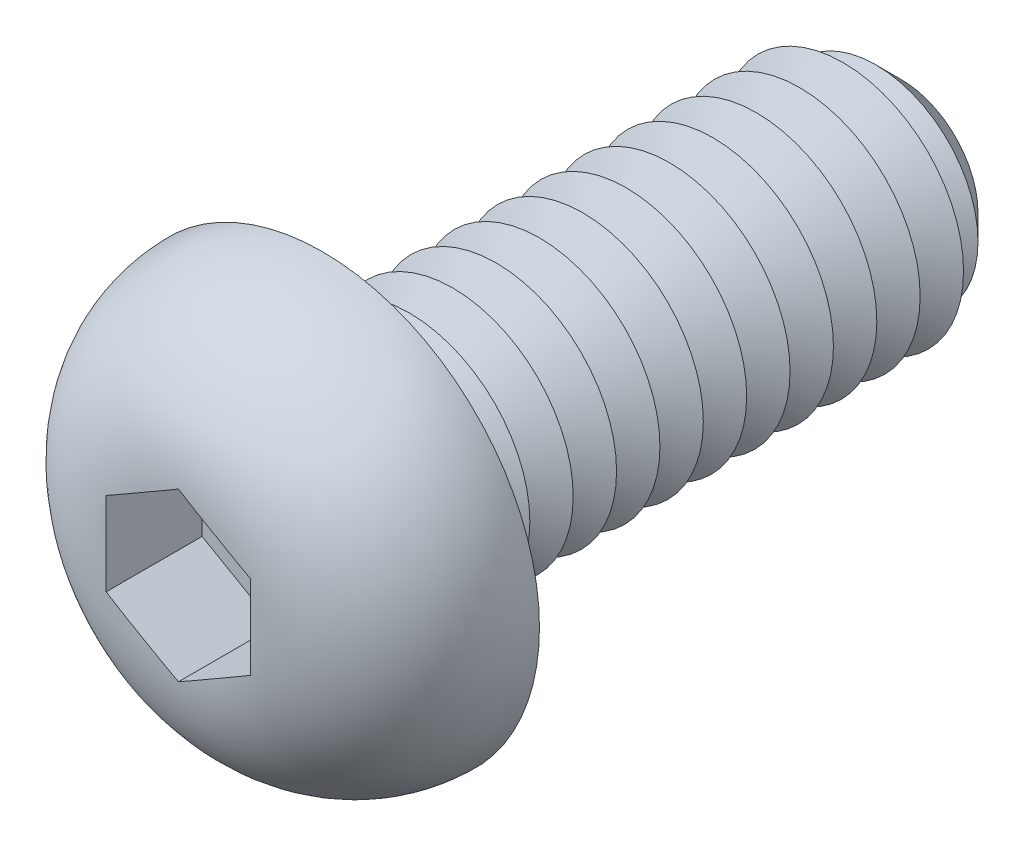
ISO-10303-21;
HEADER;
FILE_DESCRIPTION(('STEP AP214'),'2;1');
FILE_NAME('part.step','',(''),(''),'','','');
FILE_SCHEMA(('AUTOMOTIVE_DESIGN { 1 0 10303 214 1 1 1 1 }'));
ENDSEC;
DATA;
#1=APPLICATION_CONTEXT('core data for automotive mechanical design processes');
#2=APPLICATION_PROTOCOL_DEFINITION('international standard','automotive_design',2000,#1);
#3=PRODUCT_CONTEXT('',#1,'mechanical');
#4=PRODUCT('Part','Part','',(#3));
#5=PRODUCT_RELATED_PRODUCT_CATEGORY('part','',(#4));
#6=PRODUCT_DEFINITION_FORMATION('','',#4);
#7=PRODUCT_DEFINITION_CONTEXT('part definition',#1,'design');
#8=PRODUCT_DEFINITION('design','',#6,#7);
#9=PRODUCT_DEFINITION_SHAPE('','',#8);
#10=(LENGTH_UNIT() NAMED_UNIT(*) SI_UNIT(.MILLI.,.METRE.));
#11=(NAMED_UNIT(*) PLANE_ANGLE_UNIT() SI_UNIT($,.RADIAN.));
#12=(NAMED_UNIT(*) SI_UNIT($,.STERADIAN.) SOLID_ANGLE_UNIT());
#13=UNCERTAINTY_MEASURE_WITH_UNIT(LENGTH_MEASURE(1.E-05),#10,'distance_accuracy_value','');
#14=(GEOMETRIC_REPRESENTATION_CONTEXT(3) GLOBAL_UNCERTAINTY_ASSIGNED_CONTEXT((#13)) GLOBAL_UNIT_ASSIGNED_CONTEXT((#10,
#11,#12)) REPRESENTATION_CONTEXT('',''));
#15=CARTESIAN_POINT('',(0.,0.,0.));
#16=DIRECTION('',(0.,0.,1.));
#17=DIRECTION('',(1.,0.,0.));
#18=AXIS2_PLACEMENT_3D('',#15,#16,#17);
#19=CARTESIAN_POINT('',(0.,0.,-6.));
#20=DIRECTION('',(0.,0.,1.));
#21=DIRECTION('',(1.,0.,0.));
#22=AXIS2_PLACEMENT_3D('',#19,#20,#21);
#23=CYLINDRICAL_SURFACE('',#22,1.25);
#24=CARTESIAN_POINT('',(0.,0.,-0.225));
#25=DIRECTION('',(0.,0.,1.));
#26=DIRECTION('',(1.,0.,0.));
#27=AXIS2_PLACEMENT_3D('',#24,#25,#26);
#28=CIRCLE('',#27,1.25);
#29=CARTESIAN_POINT('',(1.25,0.,-0.225));
#30=VERTEX_POINT('',#29);
#31=EDGE_CURVE('E48',#30,#30,#28,.F.);
#32=ORIENTED_EDGE('',*,*,#31,.T.);
#33=EDGE_LOOP('',(#32));
#34=FACE_BOUND('',#33,.T.);
#35=CARTESIAN_POINT('',(0.,0.,-0.449999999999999));
#36=DIRECTION('',(0.,0.,1.));
#37=DIRECTION('',(1.,0.,0.));
#38=AXIS2_PLACEMENT_3D('',#35,#36,#37);
#39=CIRCLE('',#38,1.25);
#40=CARTESIAN_POINT('',(1.25,0.,-0.449999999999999));
#41=VERTEX_POINT('',#40);
#42=EDGE_CURVE('E116',#41,#41,#39,.T.);
#43=ORIENTED_EDGE('',*,*,#42,.T.);
#44=EDGE_LOOP('',(#43));
#45=FACE_BOUND('',#44,.T.);
#46=ADVANCED_FACE('F39',(#34,#45),#23,.T.);
#47=CARTESIAN_POINT('',(0.,2.25,0.));
#48=DIRECTION('',(0.,0.,1.));
#49=DIRECTION('',(1.,0.,0.));
#50=AXIS2_PLACEMENT_3D('',#47,#48,#49);
#51=PLANE('',#50);
#52=CARTESIAN_POINT('',(0.,0.,0.));
#53=DIRECTION('',(0.,0.,1.));
#54=DIRECTION('',(1.,0.,0.));
#55=AXIS2_PLACEMENT_3D('',#52,#53,#54);
#56=CIRCLE('',#55,1.475);
#57=CARTESIAN_POINT('',(1.475,0.,0.));
#58=VERTEX_POINT('',#57);
#59=EDGE_CURVE('E11',#58,#58,#56,.T.);
#60=ORIENTED_EDGE('',*,*,#59,.T.);
#61=EDGE_LOOP('',(#60));
#62=FACE_BOUND('',#61,.T.);
#63=CARTESIAN_POINT('',(0.,0.,0.));
#64=DIRECTION('',(0.,0.,1.));
#65=DIRECTION('',(1.,0.,0.));
#66=AXIS2_PLACEMENT_3D('',#63,#64,#65);
#67=CIRCLE('',#66,2.25);
#68=CARTESIAN_POINT('',(2.25,0.,0.));
#69=VERTEX_POINT('',#68);
#70=EDGE_CURVE('E140',#69,#69,#67,.T.);
#71=ORIENTED_EDGE('',*,*,#70,.F.);
#72=EDGE_LOOP('',(#71));
#73=FACE_BOUND('',#72,.T.);
#74=ADVANCED_FACE('F251',(#62,#73),#51,.F.);
#75=CARTESIAN_POINT('',(0.,0.,0.));
#76=DIRECTION('',(0.,0.,1.));
#77=DIRECTION('',(1.,0.,0.));
#78=AXIS2_PLACEMENT_3D('',#75,#76,#77);
#79=DEGENERATE_TOROIDAL_SURFACE('',#78,0.75,1.5,.T.);
#80=CARTESIAN_POINT('',(-0.00020000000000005,0.866140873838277,1.49549700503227));
#81=CARTESIAN_POINT('',(0.0310550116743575,0.848095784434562,1.4968946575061));
#82=CARTESIAN_POINT('',(0.0623199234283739,0.83004497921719,1.49783965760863));
#83=CARTESIAN_POINT('',(0.124855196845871,0.793940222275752,1.49913317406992));
#84=CARTESIAN_POINT('',(0.156125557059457,0.775886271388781,1.49948177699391));
#85=CARTESIAN_POINT('',(0.218662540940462,0.739780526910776,1.49989152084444));
#86=CARTESIAN_POINT('',(0.249929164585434,0.7217287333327,1.49995269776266));
#87=CARTESIAN_POINT('',(0.312463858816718,0.685624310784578,1.50000693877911));
#88=CARTESIAN_POINT('',(0.343731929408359,0.667571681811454,1.5));
#89=CARTESIAN_POINT('',(0.40626807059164,0.631466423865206,1.5));
#90=CARTESIAN_POINT('',(0.437536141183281,0.613413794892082,1.50000693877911));
#91=CARTESIAN_POINT('',(0.500070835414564,0.577309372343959,1.49995269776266));
#92=CARTESIAN_POINT('',(0.531337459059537,0.559257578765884,1.49989152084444));
#93=CARTESIAN_POINT('',(0.593874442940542,0.523151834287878,1.49948177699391));
#94=CARTESIAN_POINT('',(0.625144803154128,0.505097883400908,1.49913317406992));
#95=CARTESIAN_POINT('',(0.687680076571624,0.468993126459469,1.49783965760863));
#96=CARTESIAN_POINT('',(0.718944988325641,0.450942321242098,1.49689465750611));
#97=CARTESIAN_POINT('',(0.750199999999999,0.432897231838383,1.4954970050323));
#98=B_SPLINE_CURVE_WITH_KNOTS('',3,(#80,#81,#82,#83,#84,#85,#86,#87,#88,#89,#90,#91,#92,#93,#94,
#95,#96,#97),.UNSPECIFIED.,.F.,.F.,(4,2,2,2,2,2,2,2,4),(0.,0.108340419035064,0.216665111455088,
0.324976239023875,0.433291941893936,0.541607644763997,0.649918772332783,0.758243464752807,
0.866583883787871),.UNSPECIFIED.);
#99=CARTESIAN_POINT('',(0.,0.866025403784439,1.49550596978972));
#100=VERTEX_POINT('',#99);
#101=CARTESIAN_POINT('',(0.75,0.43301270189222,1.49550596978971));
#102=VERTEX_POINT('',#101);
#103=EDGE_CURVE('E62',#100,#102,#98,.T.);
#104=ORIENTED_EDGE('',*,*,#103,.T.);
#105=CARTESIAN_POINT('',(0.75,0.,1.5));
#106=CARTESIAN_POINT('',(0.75,-0.0627080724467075,1.50000006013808));
#107=CARTESIAN_POINT('',(0.75,-0.125416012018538,1.50006294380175));
#108=CARTESIAN_POINT('',(0.75,-0.250852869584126,1.49957707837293));
#109=CARTESIAN_POINT('',(0.75,-0.313581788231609,1.49902814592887));
#110=CARTESIAN_POINT('',(0.75,-0.438802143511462,1.49567950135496));
#111=CARTESIAN_POINT('',(0.75,-0.501293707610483,1.49288685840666));
#112=CARTESIAN_POINT('',(0.75,-0.625982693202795,1.48341085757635));
#113=CARTESIAN_POINT('',(0.75,-0.688180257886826,1.47672964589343));
#114=CARTESIAN_POINT('',(0.75,-0.798866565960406,1.46016399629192));
#115=CARTESIAN_POINT('',(0.75,-0.847497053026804,1.45124406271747));
#116=CARTESIAN_POINT('',(0.75,-0.943962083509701,1.42976864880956));
#117=CARTESIAN_POINT('',(0.75,-0.991796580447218,1.41721295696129));
#118=CARTESIAN_POINT('',(0.75,-1.08630476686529,1.38817887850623));
#119=CARTESIAN_POINT('',(0.75,-1.13297775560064,1.37169818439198));
#120=CARTESIAN_POINT('',(0.75,-1.22469462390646,1.33469293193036));
#121=CARTESIAN_POINT('',(0.75,-1.26973805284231,1.31416726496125));
#122=CARTESIAN_POINT('',(0.75,-1.40247100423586,1.24607127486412));
#123=CARTESIAN_POINT('',(0.750000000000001,-1.48705462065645,1.19219273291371));
#124=CARTESIAN_POINT('',(0.750000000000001,-1.64393724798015,1.06881737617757));
#125=CARTESIAN_POINT('',(0.750000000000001,-1.71623917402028,0.99932427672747));
#126=CARTESIAN_POINT('',(0.750000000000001,-1.83613547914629,0.857842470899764));
#127=CARTESIAN_POINT('',(0.750000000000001,-1.88577468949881,0.787579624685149));
#128=CARTESIAN_POINT('',(0.750000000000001,-1.97175648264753,0.639365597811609));
#129=CARTESIAN_POINT('',(0.750000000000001,-2.00810707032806,0.56141908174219));
#130=CARTESIAN_POINT('',(0.750000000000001,-2.06466924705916,0.404589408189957));
#131=CARTESIAN_POINT('',(0.750000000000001,-2.08563938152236,0.325978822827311));
#132=CARTESIAN_POINT('',(0.750000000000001,-2.11383941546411,0.166329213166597));
#133=CARTESIAN_POINT('',(0.750000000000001,-2.12107071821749,0.0852904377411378));
#134=CARTESIAN_POINT('',(0.750000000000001,-2.12155325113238,-0.0754758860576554));
#135=CARTESIAN_POINT('',(0.750000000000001,-2.11503465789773,-0.155202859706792));
#136=CARTESIAN_POINT('',(0.750000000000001,-2.08869127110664,-0.312426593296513));
#137=CARTESIAN_POINT('',(0.750000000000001,-2.06886647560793,-0.389923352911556));
#138=CARTESIAN_POINT('',(0.750000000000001,-2.01655236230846,-0.540457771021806));
#139=CARTESIAN_POINT('',(0.750000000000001,-1.98407088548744,-0.613498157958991));
#140=CARTESIAN_POINT('',(0.750000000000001,-1.9074704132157,-0.753167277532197));
#141=CARTESIAN_POINT('',(0.750000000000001,-1.86335369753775,-0.81979726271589));
#142=CARTESIAN_POINT('',(0.750000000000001,-1.76418094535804,-0.945786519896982));
#143=CARTESIAN_POINT('',(0.750000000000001,-1.70898715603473,-1.00503724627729));
#144=CARTESIAN_POINT('',(0.750000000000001,-1.58971135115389,-1.11387170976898));
#145=CARTESIAN_POINT('',(0.75,-1.52562045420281,-1.16344566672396));
#146=CARTESIAN_POINT('',(0.75,-1.38780810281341,-1.25370948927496));
#147=CARTESIAN_POINT('',(0.75,-1.31380696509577,-1.29397311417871));
#148=CARTESIAN_POINT('',(0.75,-1.19908931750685,-1.34544517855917));
#149=CARTESIAN_POINT('',(0.75,-1.16029271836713,-1.36109820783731));
#150=CARTESIAN_POINT('',(0.75,-1.08166825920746,-1.38954640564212));
#151=CARTESIAN_POINT('',(0.75,-1.04184052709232,-1.40234192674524));
#152=CARTESIAN_POINT('',(0.75,-0.922724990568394,-1.43614112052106));
#153=CARTESIAN_POINT('',(0.75,-0.842305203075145,-1.45321262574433));
#154=CARTESIAN_POINT('',(0.75,-0.680054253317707,-1.47833811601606));
#155=CARTESIAN_POINT('',(0.75,-0.598220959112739,-1.48637700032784));
#156=CARTESIAN_POINT('',(0.75,-0.432952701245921,-1.4964806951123));
#157=CARTESIAN_POINT('',(0.75,-0.349513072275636,-1.49844778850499));
#158=CARTESIAN_POINT('',(0.75,-0.224384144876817,-1.49972680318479));
#159=CARTESIAN_POINT('',(0.75,-0.182687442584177,-1.49987466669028));
#160=CARTESIAN_POINT('',(0.75,-0.0992944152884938,-1.50001027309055));
#161=CARTESIAN_POINT('',(0.75,-0.0575980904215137,-1.49999802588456));
#162=CARTESIAN_POINT('',(0.75,0.0343362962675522,-1.50000235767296));
#163=CARTESIAN_POINT('',(0.75,0.0845742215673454,-1.50002535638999));
#164=CARTESIAN_POINT('',(0.75,0.185055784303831,-1.49987831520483));
#165=CARTESIAN_POINT('',(0.75,0.235299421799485,-1.49970825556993));
#166=CARTESIAN_POINT('',(0.75,0.335816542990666,-1.49845206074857));
#167=CARTESIAN_POINT('',(0.75,0.386090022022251,-1.49736526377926));
#168=CARTESIAN_POINT('',(0.75,0.486569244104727,-1.49338674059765));
#169=CARTESIAN_POINT('',(0.75,0.536774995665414,-1.49049526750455));
#170=CARTESIAN_POINT('',(0.75,0.636034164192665,-1.4821682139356));
#171=CARTESIAN_POINT('',(0.75,0.685091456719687,-1.47678164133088));
#172=CARTESIAN_POINT('',(0.75,0.78275573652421,-1.46286947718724));
#173=CARTESIAN_POINT('',(0.75,0.831362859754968,-1.45434486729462));
#174=CARTESIAN_POINT('',(0.75,0.92771552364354,-1.43373454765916));
#175=CARTESIAN_POINT('',(0.75,0.975462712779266,-1.42165664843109));
#176=CARTESIAN_POINT('',(0.75,1.06980144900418,-1.39365234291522));
#177=CARTESIAN_POINT('',(0.75,1.11639353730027,-1.37772777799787));
#178=CARTESIAN_POINT('',(0.75,1.20164461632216,-1.3443737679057));
#179=CARTESIAN_POINT('',(0.75,1.24050600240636,-1.32746129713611));
#180=CARTESIAN_POINT('',(0.75,1.31679530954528,-1.29064565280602));
#181=CARTESIAN_POINT('',(0.75,1.35422305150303,-1.27074210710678));
#182=CARTESIAN_POINT('',(0.75,1.42755003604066,-1.22785786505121));
#183=CARTESIAN_POINT('',(0.75,1.46343995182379,-1.20486115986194));
#184=CARTESIAN_POINT('',(0.75,1.53317270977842,-1.15597138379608));
#185=CARTESIAN_POINT('',(0.75,1.56701570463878,-1.1300785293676));
#186=CARTESIAN_POINT('',(0.75,1.66513078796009,-1.04815589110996));
#187=CARTESIAN_POINT('',(0.75,1.72596640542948,-0.987895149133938));
#188=CARTESIAN_POINT('',(0.75,1.83611610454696,-0.857815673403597));
#189=CARTESIAN_POINT('',(0.75,1.88544739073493,-0.78801146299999));
#190=CARTESIAN_POINT('',(0.75,1.96970141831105,-0.64303465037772));
#191=CARTESIAN_POINT('',(0.75,2.00501928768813,-0.568092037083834));
#192=CARTESIAN_POINT('',(0.75,2.06216371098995,-0.413201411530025));
#193=CARTESIAN_POINT('',(0.75,2.08398748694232,-0.333252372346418));
#194=CARTESIAN_POINT('',(0.75,2.11297506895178,-0.173098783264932));
#195=CARTESIAN_POINT('',(0.75,2.12053880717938,-0.0929664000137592));
#196=CARTESIAN_POINT('',(0.75,2.1219864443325,0.0674127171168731));
#197=CARTESIAN_POINT('',(0.75,2.1158724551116,0.147659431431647));
#198=CARTESIAN_POINT('',(0.75,2.09026719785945,0.305329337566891));
#199=CARTESIAN_POINT('',(0.75,2.07088260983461,0.382769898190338));
#200=CARTESIAN_POINT('',(0.75,2.01945905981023,0.53332273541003));
#201=CARTESIAN_POINT('',(0.75,1.98742024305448,0.606435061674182));
#202=CARTESIAN_POINT('',(0.75,1.91146692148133,0.746751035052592));
#203=CARTESIAN_POINT('',(0.75,1.86748433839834,0.813917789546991));
#204=CARTESIAN_POINT('',(0.75,1.76910058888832,0.940116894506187));
#205=CARTESIAN_POINT('',(0.75,1.71469868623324,0.999148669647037));
#206=CARTESIAN_POINT('',(0.75,1.59577189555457,1.10896258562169));
#207=CARTESIAN_POINT('',(0.75,1.53104176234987,1.15952203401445));
#208=CARTESIAN_POINT('',(0.75,1.3944150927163,1.24972990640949));
#209=CARTESIAN_POINT('',(0.75,1.32251811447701,1.28937765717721));
#210=CARTESIAN_POINT('',(0.75,1.16914901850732,1.35951213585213));
#211=CARTESIAN_POINT('',(0.75,1.08736098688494,1.38930295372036));
#212=CARTESIAN_POINT('',(0.75,0.920496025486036,1.43689243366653));
#213=CARTESIAN_POINT('',(0.75,0.835420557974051,1.45469636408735));
#214=CARTESIAN_POINT('',(0.75,0.687870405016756,1.476773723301));
#215=CARTESIAN_POINT('',(0.75,0.625720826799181,1.48343749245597));
#216=CARTESIAN_POINT('',(0.75,0.501109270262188,1.49289411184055));
#217=CARTESIAN_POINT('',(0.75,0.438647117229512,1.49568447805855));
#218=CARTESIAN_POINT('',(0.75,0.313477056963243,1.49903009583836));
#219=CARTESIAN_POINT('',(0.75,0.250769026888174,1.49957783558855));
#220=CARTESIAN_POINT('',(0.75,0.125373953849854,1.50006266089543));
#221=CARTESIAN_POINT('',(0.75,0.0626869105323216,1.49999993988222));
#222=CARTESIAN_POINT('',(0.75,0.,1.5));
#223=B_SPLINE_CURVE_WITH_KNOTS('',3,(#105,#106,#107,#108,#109,#110,#111,#112,#113,#114,#115,
#116,#117,#118,#119,#120,#121,#122,#123,#124,#125,#126,#127,#128,#129,#130,#131,#132,#133,#134,
#135,#136,#137,#138,#139,#140,#141,#142,#143,#144,#145,#146,#147,#148,#149,#150,#151,#152,#153,
#154,#155,#156,#157,#158,#159,#160,#161,#162,#163,#164,#165,#166,#167,#168,#169,#170,#171,#172,
#173,#174,#175,#176,#177,#178,#179,#180,#181,#182,#183,#184,#185,#186,#187,#188,#189,#190,#191,
#192,#193,#194,#195,#196,#197,#198,#199,#200,#201,#202,#203,#204,#205,#206,#207,#208,#209,#210,
#211,#212,#213,#214,#215,#216,#217,#218,#219,#220,#221,#222),.UNSPECIFIED.,.T.,.F.,(4,2,2,2,2,2,
2,2,2,2,2,2,2,2,2,2,2,2,2,2,2,2,2,2,2,2,2,2,2,2,2,2,2,2,2,2,2,2,2,2,2,2,2,2,2,2,2,2,2,2,2,2,2,2,
2,2,2,2,4),(0.,0.188125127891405,0.376306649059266,0.563897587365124,0.75138508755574,
0.899588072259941,1.04779968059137,1.19609863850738,1.34443829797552,1.64330264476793,
1.94209595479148,2.19886247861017,2.45547407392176,2.69837467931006,2.94125047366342,
3.18009276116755,3.418935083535,3.65762967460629,3.89627753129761,4.13810096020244,
4.38016754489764,4.63175737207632,4.75717060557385,4.88256835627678,5.12849835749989,
5.37483889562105,5.62512380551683,5.75021912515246,5.87530671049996,6.02602122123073,
6.17675113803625,6.32758995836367,6.47840762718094,6.62638101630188,6.77430815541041,
6.92191253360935,7.06944639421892,7.19647012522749,7.32350967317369,7.4512340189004,
7.57894882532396,7.83445576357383,8.08957810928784,8.33688433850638,8.58424146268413,
8.82455168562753,9.06482480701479,9.30318875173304,9.54154996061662,9.781299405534,
10.0210657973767,10.266384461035,10.511718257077,10.7718340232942,11.0318353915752,
11.219209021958,11.4067027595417,11.5948240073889,11.7828856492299),.UNSPECIFIED.);
#224=CARTESIAN_POINT('',(0.75,-0.43301270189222,1.49550596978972));
#225=VERTEX_POINT('',#224);
#226=EDGE_CURVE('E215',#102,#225,#223,.T.);
#227=ORIENTED_EDGE('',*,*,#226,.T.);
#228=CARTESIAN_POINT('',(0.7502,-0.432897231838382,1.49549700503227));
#229=CARTESIAN_POINT('',(0.718944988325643,-0.450942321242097,1.4968946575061));
#230=CARTESIAN_POINT('',(0.687680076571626,-0.468993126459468,1.49783965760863));
#231=CARTESIAN_POINT('',(0.625144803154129,-0.505097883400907,1.49913317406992));
#232=CARTESIAN_POINT('',(0.593874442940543,-0.523151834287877,1.49948177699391));
#233=CARTESIAN_POINT('',(0.531337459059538,-0.559257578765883,1.49989152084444));
#234=CARTESIAN_POINT('',(0.500070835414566,-0.577309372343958,1.49995269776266));
#235=CARTESIAN_POINT('',(0.437536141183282,-0.613413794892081,1.50000693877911));
#236=CARTESIAN_POINT('',(0.406268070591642,-0.631466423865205,1.5));
#237=CARTESIAN_POINT('',(0.34373192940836,-0.667571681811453,1.5));
#238=CARTESIAN_POINT('',(0.312463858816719,-0.685624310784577,1.50000693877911));
#239=CARTESIAN_POINT('',(0.249929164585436,-0.721728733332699,1.49995269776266));
#240=CARTESIAN_POINT('',(0.218662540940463,-0.739780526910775,1.49989152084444));
#241=CARTESIAN_POINT('',(0.156125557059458,-0.77588627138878,1.49948177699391));
#242=CARTESIAN_POINT('',(0.124855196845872,-0.793940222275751,1.49913317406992));
#243=CARTESIAN_POINT('',(0.0623199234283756,-0.830044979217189,1.49783965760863));
#244=CARTESIAN_POINT('',(0.0310550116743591,-0.848095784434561,1.49689465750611));
#245=CARTESIAN_POINT('',(-0.000199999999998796,-0.866140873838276,1.4954970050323));
#246=B_SPLINE_CURVE_WITH_KNOTS('',3,(#228,#229,#230,#231,#232,#233,#234,#235,#236,#237,#238,
#239,#240,#241,#242,#243,#244,#245),.UNSPECIFIED.,.F.,.F.,(4,2,2,2,2,2,2,2,4),(0.,
0.108340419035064,0.216665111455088,0.324976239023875,0.433291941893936,0.541607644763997,
0.649918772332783,0.758243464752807,0.866583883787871),.UNSPECIFIED.);
#247=CARTESIAN_POINT('',(0.,-0.866025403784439,1.49550596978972));
#248=VERTEX_POINT('',#247);
#249=EDGE_CURVE('E195',#225,#248,#246,.T.);
#250=ORIENTED_EDGE('',*,*,#249,.T.);
#251=CARTESIAN_POINT('',(0.000200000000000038,-0.866140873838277,1.49549700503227));
#252=CARTESIAN_POINT('',(-0.0310550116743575,-0.848095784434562,1.4968946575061));
#253=CARTESIAN_POINT('',(-0.0623199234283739,-0.83004497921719,1.49783965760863));
#254=CARTESIAN_POINT('',(-0.124855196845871,-0.793940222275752,1.49913317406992));
#255=CARTESIAN_POINT('',(-0.156125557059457,-0.775886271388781,1.49948177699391));
#256=CARTESIAN_POINT('',(-0.218662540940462,-0.739780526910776,1.49989152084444));
#257=CARTESIAN_POINT('',(-0.249929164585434,-0.7217287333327,1.49995269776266));
#258=CARTESIAN_POINT('',(-0.312463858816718,-0.685624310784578,1.50000693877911));
#259=CARTESIAN_POINT('',(-0.343731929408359,-0.667571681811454,1.5));
#260=CARTESIAN_POINT('',(-0.40626807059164,-0.631466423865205,1.5));
#261=CARTESIAN_POINT('',(-0.437536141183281,-0.613413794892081,1.50000693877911));
#262=CARTESIAN_POINT('',(-0.500070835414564,-0.577309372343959,1.49995269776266));
#263=CARTESIAN_POINT('',(-0.531337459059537,-0.559257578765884,1.49989152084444));
#264=CARTESIAN_POINT('',(-0.593874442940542,-0.523151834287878,1.49948177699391));
#265=CARTESIAN_POINT('',(-0.625144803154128,-0.505097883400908,1.49913317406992));
#266=CARTESIAN_POINT('',(-0.687680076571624,-0.468993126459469,1.49783965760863));
#267=CARTESIAN_POINT('',(-0.718944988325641,-0.450942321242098,1.49689465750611));
#268=CARTESIAN_POINT('',(-0.750199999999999,-0.432897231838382,1.4954970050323));
#269=B_SPLINE_CURVE_WITH_KNOTS('',3,(#251,#252,#253,#254,#255,#256,#257,#258,#259,#260,#261,
#262,#263,#264,#265,#266,#267,#268),.UNSPECIFIED.,.F.,.F.,(4,2,2,2,2,2,2,2,4),(0.,
0.108340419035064,0.216665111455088,0.324976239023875,0.433291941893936,0.541607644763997,
0.649918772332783,0.758243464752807,0.866583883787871),.UNSPECIFIED.);
#270=CARTESIAN_POINT('',(-0.75,-0.433012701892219,1.49550596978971));
#271=VERTEX_POINT('',#270);
#272=EDGE_CURVE('E188',#248,#271,#269,.T.);
#273=ORIENTED_EDGE('',*,*,#272,.T.);
#274=CARTESIAN_POINT('',(-0.75,0.,1.5));
#275=CARTESIAN_POINT('',(-0.75,0.0627080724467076,1.50000006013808));
#276=CARTESIAN_POINT('',(-0.75,0.125416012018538,1.50006294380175));
#277=CARTESIAN_POINT('',(-0.75,0.250852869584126,1.49957707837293));
#278=CARTESIAN_POINT('',(-0.75,0.313581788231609,1.49902814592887));
#279=CARTESIAN_POINT('',(-0.75,0.438802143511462,1.49567950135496));
#280=CARTESIAN_POINT('',(-0.75,0.501293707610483,1.49288685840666));
#281=CARTESIAN_POINT('',(-0.75,0.625982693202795,1.48341085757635));
#282=CARTESIAN_POINT('',(-0.75,0.688180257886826,1.47672964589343));
#283=CARTESIAN_POINT('',(-0.75,0.798866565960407,1.46016399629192));
#284=CARTESIAN_POINT('',(-0.75,0.847497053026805,1.45124406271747));
#285=CARTESIAN_POINT('',(-0.75,0.943962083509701,1.42976864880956));
#286=CARTESIAN_POINT('',(-0.75,0.991796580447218,1.41721295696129));
#287=CARTESIAN_POINT('',(-0.75,1.08630476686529,1.38817887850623));
#288=CARTESIAN_POINT('',(-0.75,1.13297775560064,1.37169818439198));
#289=CARTESIAN_POINT('',(-0.75,1.22469462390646,1.33469293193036));
#290=CARTESIAN_POINT('',(-0.75,1.26973805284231,1.31416726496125));
#291=CARTESIAN_POINT('',(-0.75,1.40247100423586,1.24607127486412));
#292=CARTESIAN_POINT('',(-0.75,1.48705462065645,1.19219273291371));
#293=CARTESIAN_POINT('',(-0.75,1.64393724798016,1.06881737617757));
#294=CARTESIAN_POINT('',(-0.75,1.71623917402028,0.99932427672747));
#295=CARTESIAN_POINT('',(-0.75,1.83613547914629,0.857842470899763));
#296=CARTESIAN_POINT('',(-0.75,1.88577468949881,0.787579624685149));
#297=CARTESIAN_POINT('',(-0.75,1.97175648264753,0.639365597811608));
#298=CARTESIAN_POINT('',(-0.75,2.00810707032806,0.561419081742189));
#299=CARTESIAN_POINT('',(-0.75,2.06466924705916,0.404589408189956));
#300=CARTESIAN_POINT('',(-0.75,2.08563938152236,0.325978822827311));
#301=CARTESIAN_POINT('',(-0.75,2.11383941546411,0.166329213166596));
#302=CARTESIAN_POINT('',(-0.75,2.12107071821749,0.0852904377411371));
#303=CARTESIAN_POINT('',(-0.75,2.12155325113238,-0.0754758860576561));
#304=CARTESIAN_POINT('',(-0.75,2.11503465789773,-0.155202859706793));
#305=CARTESIAN_POINT('',(-0.75,2.08869127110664,-0.312426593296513));
#306=CARTESIAN_POINT('',(-0.75,2.06886647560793,-0.389923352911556));
#307=CARTESIAN_POINT('',(-0.75,2.01655236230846,-0.540457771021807));
#308=CARTESIAN_POINT('',(-0.75,1.98407088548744,-0.613498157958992));
#309=CARTESIAN_POINT('',(-0.75,1.9074704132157,-0.753167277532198));
#310=CARTESIAN_POINT('',(-0.75,1.86335369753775,-0.81979726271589));
#311=CARTESIAN_POINT('',(-0.75,1.76418094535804,-0.945786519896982));
#312=CARTESIAN_POINT('',(-0.75,1.70898715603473,-1.00503724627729));
#313=CARTESIAN_POINT('',(-0.75,1.58971135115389,-1.11387170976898));
#314=CARTESIAN_POINT('',(-0.75,1.52562045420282,-1.16344566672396));
#315=CARTESIAN_POINT('',(-0.75,1.38780810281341,-1.25370948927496));
#316=CARTESIAN_POINT('',(-0.75,1.31380696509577,-1.29397311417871));
#317=CARTESIAN_POINT('',(-0.75,1.19908931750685,-1.34544517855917));
#318=CARTESIAN_POINT('',(-0.75,1.16029271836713,-1.36109820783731));
#319=CARTESIAN_POINT('',(-0.75,1.08166825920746,-1.38954640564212));
#320=CARTESIAN_POINT('',(-0.75,1.04184052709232,-1.40234192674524));
#321=CARTESIAN_POINT('',(-0.75,0.922724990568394,-1.43614112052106));
#322=CARTESIAN_POINT('',(-0.75,0.842305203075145,-1.45321262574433));
#323=CARTESIAN_POINT('',(-0.75,0.680054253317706,-1.47833811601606));
#324=CARTESIAN_POINT('',(-0.75,0.598220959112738,-1.48637700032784));
#325=CARTESIAN_POINT('',(-0.75,0.43295270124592,-1.4964806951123));
#326=CARTESIAN_POINT('',(-0.75,0.349513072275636,-1.49844778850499));
#327=CARTESIAN_POINT('',(-0.75,0.224384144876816,-1.49972680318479));
#328=CARTESIAN_POINT('',(-0.75,0.182687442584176,-1.49987466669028));
#329=CARTESIAN_POINT('',(-0.75,0.0992944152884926,-1.50001027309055));
#330=CARTESIAN_POINT('',(-0.75,0.0575980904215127,-1.49999802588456));
#331=CARTESIAN_POINT('',(-0.75,-0.0343362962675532,-1.50000235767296));
#332=CARTESIAN_POINT('',(-0.75,-0.0845742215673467,-1.50002535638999));
#333=CARTESIAN_POINT('',(-0.75,-0.185055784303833,-1.49987831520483));
#334=CARTESIAN_POINT('',(-0.75,-0.235299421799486,-1.49970825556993));
#335=CARTESIAN_POINT('',(-0.75,-0.335816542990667,-1.49845206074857));
#336=CARTESIAN_POINT('',(-0.75,-0.386090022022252,-1.49736526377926));
#337=CARTESIAN_POINT('',(-0.75,-0.486569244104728,-1.49338674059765));
#338=CARTESIAN_POINT('',(-0.75,-0.536774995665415,-1.49049526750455));
#339=CARTESIAN_POINT('',(-0.75,-0.636034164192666,-1.4821682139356));
#340=CARTESIAN_POINT('',(-0.75,-0.685091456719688,-1.47678164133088));
#341=CARTESIAN_POINT('',(-0.75,-0.782755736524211,-1.46286947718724));
#342=CARTESIAN_POINT('',(-0.75,-0.831362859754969,-1.45434486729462));
#343=CARTESIAN_POINT('',(-0.75,-0.927715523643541,-1.43373454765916));
#344=CARTESIAN_POINT('',(-0.75,-0.975462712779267,-1.42165664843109));
#345=CARTESIAN_POINT('',(-0.75,-1.06980144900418,-1.39365234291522));
#346=CARTESIAN_POINT('',(-0.75,-1.11639353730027,-1.37772777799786));
#347=CARTESIAN_POINT('',(-0.75,-1.20164461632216,-1.3443737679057));
#348=CARTESIAN_POINT('',(-0.75,-1.24050600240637,-1.32746129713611));
#349=CARTESIAN_POINT('',(-0.75,-1.31679530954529,-1.29064565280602));
#350=CARTESIAN_POINT('',(-0.75,-1.35422305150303,-1.27074210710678));
#351=CARTESIAN_POINT('',(-0.75,-1.42755003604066,-1.22785786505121));
#352=CARTESIAN_POINT('',(-0.75,-1.46343995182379,-1.20486115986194));
#353=CARTESIAN_POINT('',(-0.75,-1.53317270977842,-1.15597138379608));
#354=CARTESIAN_POINT('',(-0.75,-1.56701570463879,-1.1300785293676));
#355=CARTESIAN_POINT('',(-0.75,-1.66513078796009,-1.04815589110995));
#356=CARTESIAN_POINT('',(-0.75,-1.72596640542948,-0.987895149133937));
#357=CARTESIAN_POINT('',(-0.75,-1.83611610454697,-0.857815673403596));
#358=CARTESIAN_POINT('',(-0.75,-1.88544739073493,-0.788011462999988));
#359=CARTESIAN_POINT('',(-0.75,-1.96970141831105,-0.643034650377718));
#360=CARTESIAN_POINT('',(-0.75,-2.00501928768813,-0.568092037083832));
#361=CARTESIAN_POINT('',(-0.75,-2.06216371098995,-0.413201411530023));
#362=CARTESIAN_POINT('',(-0.75,-2.08398748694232,-0.333252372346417));
#363=CARTESIAN_POINT('',(-0.75,-2.11297506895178,-0.173098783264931));
#364=CARTESIAN_POINT('',(-0.75,-2.12053880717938,-0.0929664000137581));
#365=CARTESIAN_POINT('',(-0.75,-2.1219864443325,0.0674127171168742));
#366=CARTESIAN_POINT('',(-0.75,-2.1158724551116,0.147659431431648));
#367=CARTESIAN_POINT('',(-0.75,-2.09026719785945,0.305329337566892));
#368=CARTESIAN_POINT('',(-0.75,-2.07088260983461,0.382769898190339));
#369=CARTESIAN_POINT('',(-0.75,-2.01945905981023,0.533322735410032));
#370=CARTESIAN_POINT('',(-0.75,-1.98742024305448,0.606435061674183));
#371=CARTESIAN_POINT('',(-0.75,-1.91146692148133,0.746751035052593));
#372=CARTESIAN_POINT('',(-0.75,-1.86748433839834,0.813917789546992));
#373=CARTESIAN_POINT('',(-0.75,-1.76910058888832,0.940116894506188));
#374=CARTESIAN_POINT('',(-0.75,-1.71469868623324,0.999148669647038));
#375=CARTESIAN_POINT('',(-0.75,-1.59577189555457,1.10896258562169));
#376=CARTESIAN_POINT('',(-0.75,-1.53104176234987,1.15952203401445));
#377=CARTESIAN_POINT('',(-0.75,-1.3944150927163,1.24972990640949));
#378=CARTESIAN_POINT('',(-0.75,-1.32251811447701,1.28937765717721));
#379=CARTESIAN_POINT('',(-0.75,-1.16914901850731,1.35951213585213));
#380=CARTESIAN_POINT('',(-0.75,-1.08736098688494,1.38930295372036));
#381=CARTESIAN_POINT('',(-0.75,-0.920496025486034,1.43689243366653));
#382=CARTESIAN_POINT('',(-0.75,-0.83542055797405,1.45469636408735));
#383=CARTESIAN_POINT('',(-0.75,-0.687870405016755,1.476773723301));
#384=CARTESIAN_POINT('',(-0.75,-0.625720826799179,1.48343749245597));
#385=CARTESIAN_POINT('',(-0.75,-0.501109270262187,1.49289411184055));
#386=CARTESIAN_POINT('',(-0.75,-0.438647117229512,1.49568447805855));
#387=CARTESIAN_POINT('',(-0.75,-0.313477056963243,1.49903009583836));
#388=CARTESIAN_POINT('',(-0.75,-0.250769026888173,1.49957783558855));
#389=CARTESIAN_POINT('',(-0.75,-0.125373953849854,1.50006266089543));
#390=CARTESIAN_POINT('',(-0.75,-0.0626869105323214,1.49999993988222));
#391=CARTESIAN_POINT('',(-0.75,0.,1.5));
#392=B_SPLINE_CURVE_WITH_KNOTS('',3,(#274,#275,#276,#277,#278,#279,#280,#281,#282,#283,#284,
#285,#286,#287,#288,#289,#290,#291,#292,#293,#294,#295,#296,#297,#298,#299,#300,#301,#302,#303,
#304,#305,#306,#307,#308,#309,#310,#311,#312,#313,#314,#315,#316,#317,#318,#319,#320,#321,#322,
#323,#324,#325,#326,#327,#328,#329,#330,#331,#332,#333,#334,#335,#336,#337,#338,#339,#340,#341,
#342,#343,#344,#345,#346,#347,#348,#349,#350,#351,#352,#353,#354,#355,#356,#357,#358,#359,#360,
#361,#362,#363,#364,#365,#366,#367,#368,#369,#370,#371,#372,#373,#374,#375,#376,#377,#378,#379,
#380,#381,#382,#383,#384,#385,#386,#387,#388,#389,#390,#391),.UNSPECIFIED.,.T.,.F.,(4,2,2,2,2,2,
2,2,2,2,2,2,2,2,2,2,2,2,2,2,2,2,2,2,2,2,2,2,2,2,2,2,2,2,2,2,2,2,2,2,2,2,2,2,2,2,2,2,2,2,2,2,2,2,
2,2,2,2,4),(0.,0.188125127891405,0.376306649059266,0.563897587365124,0.75138508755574,
0.899588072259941,1.04779968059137,1.19609863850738,1.34443829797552,1.64330264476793,
1.94209595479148,2.19886247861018,2.45547407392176,2.69837467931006,2.94125047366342,
3.18009276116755,3.418935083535,3.65762967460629,3.89627753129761,4.13810096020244,
4.38016754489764,4.63175737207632,4.75717060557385,4.88256835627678,5.12849835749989,
5.37483889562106,5.62512380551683,5.75021912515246,5.87530671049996,6.02602122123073,
6.17675113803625,6.32758995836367,6.47840762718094,6.62638101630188,6.77430815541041,
6.92191253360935,7.06944639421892,7.19647012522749,7.32350967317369,7.4512340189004,
7.57894882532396,7.83445576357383,8.08957810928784,8.33688433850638,8.58424146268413,
8.82455168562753,9.06482480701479,9.30318875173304,9.54154996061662,9.781299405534,
10.0210657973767,10.266384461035,10.511718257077,10.7718340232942,11.0318353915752,
11.219209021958,11.4067027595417,11.5948240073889,11.7828856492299),.UNSPECIFIED.);
#393=CARTESIAN_POINT('',(-0.75,0.43301270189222,1.49550596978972));
#394=VERTEX_POINT('',#393);
#395=EDGE_CURVE('E166',#271,#394,#392,.T.);
#396=ORIENTED_EDGE('',*,*,#395,.T.);
#397=CARTESIAN_POINT('',(-0.7502,0.432897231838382,1.49549700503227));
#398=CARTESIAN_POINT('',(-0.718944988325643,0.450942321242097,1.4968946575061));
#399=CARTESIAN_POINT('',(-0.687680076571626,0.468993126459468,1.49783965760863));
#400=CARTESIAN_POINT('',(-0.62514480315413,0.505097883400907,1.49913317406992));
#401=CARTESIAN_POINT('',(-0.593874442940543,0.523151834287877,1.49948177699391));
#402=CARTESIAN_POINT('',(-0.531337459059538,0.559257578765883,1.49989152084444));
#403=CARTESIAN_POINT('',(-0.500070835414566,0.577309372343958,1.49995269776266));
#404=CARTESIAN_POINT('',(-0.437536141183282,0.613413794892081,1.50000693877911));
#405=CARTESIAN_POINT('',(-0.406268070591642,0.631466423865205,1.5));
#406=CARTESIAN_POINT('',(-0.34373192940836,0.667571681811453,1.5));
#407=CARTESIAN_POINT('',(-0.312463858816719,0.685624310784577,1.50000693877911));
#408=CARTESIAN_POINT('',(-0.249929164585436,0.721728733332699,1.49995269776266));
#409=CARTESIAN_POINT('',(-0.218662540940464,0.739780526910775,1.49989152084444));
#410=CARTESIAN_POINT('',(-0.156125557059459,0.77588627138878,1.49948177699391));
#411=CARTESIAN_POINT('',(-0.124855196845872,0.793940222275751,1.49913317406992));
#412=CARTESIAN_POINT('',(-0.0623199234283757,0.830044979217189,1.49783965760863));
#413=CARTESIAN_POINT('',(-0.0310550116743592,0.848095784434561,1.49689465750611));
#414=CARTESIAN_POINT('',(0.000199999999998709,0.866140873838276,1.4954970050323));
#415=B_SPLINE_CURVE_WITH_KNOTS('',3,(#397,#398,#399,#400,#401,#402,#403,#404,#405,#406,#407,
#408,#409,#410,#411,#412,#413,#414),.UNSPECIFIED.,.F.,.F.,(4,2,2,2,2,2,2,2,4),(0.,
0.108340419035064,0.216665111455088,0.324976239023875,0.433291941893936,0.541607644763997,
0.649918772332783,0.758243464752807,0.866583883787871),.UNSPECIFIED.);
#416=EDGE_CURVE('E158',#394,#100,#415,.T.);
#417=ORIENTED_EDGE('',*,*,#416,.T.);
#418=EDGE_LOOP('',(#104,#227,#250,#273,#396,#417));
#419=FACE_BOUND('',#418,.T.);
#420=ORIENTED_EDGE('',*,*,#70,.T.);
#421=EDGE_LOOP('',(#420));
#422=FACE_BOUND('',#421,.T.);
#423=ADVANCED_FACE('F171',(#419,#422),#79,.T.);
#424=CARTESIAN_POINT('',(0.75,0.43301270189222,0.5));
#425=DIRECTION('',(0.5,0.866025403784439,0.));
#426=DIRECTION('',(-0.866025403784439,0.5,0.));
#427=AXIS2_PLACEMENT_3D('',#424,#425,#426);
#428=PLANE('',#427);
#429=DIRECTION('',(0.,0.,1.));
#430=VECTOR('',#429,1.);
#431=CARTESIAN_POINT('',(0.,0.866025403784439,0.5));
#432=LINE('',#431,#430);
#433=CARTESIAN_POINT('',(0.,0.866025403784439,0.5));
#434=VERTEX_POINT('',#433);
#435=EDGE_CURVE('E55',#434,#100,#432,.T.);
#436=ORIENTED_EDGE('',*,*,#435,.F.);
#437=DIRECTION('',(-0.866025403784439,0.5,0.));
#438=VECTOR('',#437,1.);
#439=CARTESIAN_POINT('',(0.75,0.43301270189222,0.5));
#440=LINE('',#439,#438);
#441=CARTESIAN_POINT('',(0.75,0.43301270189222,0.5));
#442=VERTEX_POINT('',#441);
#443=EDGE_CURVE('E96',#442,#434,#440,.T.);
#444=ORIENTED_EDGE('',*,*,#443,.F.);
#445=DIRECTION('',(0.,0.,1.));
#446=VECTOR('',#445,1.);
#447=CARTESIAN_POINT('',(0.75,0.43301270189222,0.5));
#448=LINE('',#447,#446);
#449=EDGE_CURVE('E137',#442,#102,#448,.T.);
#450=ORIENTED_EDGE('',*,*,#449,.T.);
#451=ORIENTED_EDGE('',*,*,#103,.F.);
#452=EDGE_LOOP('',(#436,#444,#450,#451));
#453=FACE_BOUND('',#452,.T.);
#454=ADVANCED_FACE('F93',(#453),#428,.F.);
#455=CARTESIAN_POINT('',(0.75,-0.43301270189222,0.5));
#456=DIRECTION('',(1.,0.,0.));
#457=DIRECTION('',(0.,1.,0.));
#458=AXIS2_PLACEMENT_3D('',#455,#456,#457);
#459=PLANE('',#458);
#460=ORIENTED_EDGE('',*,*,#226,.F.);
#461=ORIENTED_EDGE('',*,*,#449,.F.);
#462=DIRECTION('',(0.,1.,0.));
#463=VECTOR('',#462,1.);
#464=CARTESIAN_POINT('',(0.75,-0.43301270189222,0.5));
#465=LINE('',#464,#463);
#466=CARTESIAN_POINT('',(0.75,-0.43301270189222,0.5));
#467=VERTEX_POINT('',#466);
#468=EDGE_CURVE('E100',#467,#442,#465,.T.);
#469=ORIENTED_EDGE('',*,*,#468,.F.);
#470=DIRECTION('',(0.,0.,1.));
#471=VECTOR('',#470,1.);
#472=CARTESIAN_POINT('',(0.75,-0.43301270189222,0.5));
#473=LINE('',#472,#471);
#474=EDGE_CURVE('E141',#467,#225,#473,.T.);
#475=ORIENTED_EDGE('',*,*,#474,.T.);
#476=EDGE_LOOP('',(#460,#461,#469,#475));
#477=FACE_BOUND('',#476,.T.);
#478=ADVANCED_FACE('F182',(#477),#459,.F.);
#479=CARTESIAN_POINT('',(0.,-0.866025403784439,0.5));
#480=DIRECTION('',(0.5,-0.866025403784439,0.));
#481=DIRECTION('',(0.866025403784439,0.5,0.));
#482=AXIS2_PLACEMENT_3D('',#479,#480,#481);
#483=PLANE('',#482);
#484=ORIENTED_EDGE('',*,*,#474,.F.);
#485=DIRECTION('',(0.866025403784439,0.5,0.));
#486=VECTOR('',#485,1.);
#487=CARTESIAN_POINT('',(0.,-0.866025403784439,0.5));
#488=LINE('',#487,#486);
#489=CARTESIAN_POINT('',(0.,-0.866025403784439,0.5));
#490=VERTEX_POINT('',#489);
#491=EDGE_CURVE('E132',#490,#467,#488,.T.);
#492=ORIENTED_EDGE('',*,*,#491,.F.);
#493=DIRECTION('',(0.,0.,1.));
#494=VECTOR('',#493,1.);
#495=CARTESIAN_POINT('',(0.,-0.866025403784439,0.5));
#496=LINE('',#495,#494);
#497=EDGE_CURVE('E145',#490,#248,#496,.T.);
#498=ORIENTED_EDGE('',*,*,#497,.T.);
#499=ORIENTED_EDGE('',*,*,#249,.F.);
#500=EDGE_LOOP('',(#484,#492,#498,#499));
#501=FACE_BOUND('',#500,.T.);
#502=ADVANCED_FACE('F204',(#501),#483,.F.);
#503=CARTESIAN_POINT('',(-0.75,-0.433012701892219,0.5));
#504=DIRECTION('',(-0.5,-0.866025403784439,0.));
#505=DIRECTION('',(0.866025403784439,-0.5,0.));
#506=AXIS2_PLACEMENT_3D('',#503,#504,#505);
#507=PLANE('',#506);
#508=ORIENTED_EDGE('',*,*,#497,.F.);
#509=DIRECTION('',(0.866025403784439,-0.5,0.));
#510=VECTOR('',#509,1.);
#511=CARTESIAN_POINT('',(-0.75,-0.433012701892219,0.5));
#512=LINE('',#511,#510);
#513=CARTESIAN_POINT('',(-0.75,-0.433012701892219,0.5));
#514=VERTEX_POINT('',#513);
#515=EDGE_CURVE('E128',#514,#490,#512,.T.);
#516=ORIENTED_EDGE('',*,*,#515,.F.);
#517=DIRECTION('',(0.,0.,1.));
#518=VECTOR('',#517,1.);
#519=CARTESIAN_POINT('',(-0.75,-0.433012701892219,0.5));
#520=LINE('',#519,#518);
#521=EDGE_CURVE('E149',#514,#271,#520,.T.);
#522=ORIENTED_EDGE('',*,*,#521,.T.);
#523=ORIENTED_EDGE('',*,*,#272,.F.);
#524=EDGE_LOOP('',(#508,#516,#522,#523));
#525=FACE_BOUND('',#524,.T.);
#526=ADVANCED_FACE('F201',(#525),#507,.F.);
#527=CARTESIAN_POINT('',(-0.75,0.43301270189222,0.5));
#528=DIRECTION('',(-1.,0.,0.));
#529=DIRECTION('',(0.,-1.,0.));
#530=AXIS2_PLACEMENT_3D('',#527,#528,#529);
#531=PLANE('',#530);
#532=ORIENTED_EDGE('',*,*,#395,.F.);
#533=ORIENTED_EDGE('',*,*,#521,.F.);
#534=DIRECTION('',(0.,-1.,0.));
#535=VECTOR('',#534,1.);
#536=CARTESIAN_POINT('',(-0.75,0.43301270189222,0.5));
#537=LINE('',#536,#535);
#538=CARTESIAN_POINT('',(-0.75,0.43301270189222,0.5));
#539=VERTEX_POINT('',#538);
#540=EDGE_CURVE('E110',#539,#514,#537,.T.);
#541=ORIENTED_EDGE('',*,*,#540,.F.);
#542=DIRECTION('',(0.,0.,1.));
#543=VECTOR('',#542,1.);
#544=CARTESIAN_POINT('',(-0.75,0.43301270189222,0.5));
#545=LINE('',#544,#543);
#546=EDGE_CURVE('E99',#539,#394,#545,.T.);
#547=ORIENTED_EDGE('',*,*,#546,.T.);
#548=EDGE_LOOP('',(#532,#533,#541,#547));
#549=FACE_BOUND('',#548,.T.);
#550=ADVANCED_FACE('F177',(#549),#531,.F.);
#551=CARTESIAN_POINT('',(0.,0.866025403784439,0.5));
#552=DIRECTION('',(-0.5,0.866025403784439,0.));
#553=DIRECTION('',(-0.866025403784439,-0.5,0.));
#554=AXIS2_PLACEMENT_3D('',#551,#552,#553);
#555=PLANE('',#554);
#556=ORIENTED_EDGE('',*,*,#546,.F.);
#557=DIRECTION('',(-0.866025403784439,-0.5,0.));
#558=VECTOR('',#557,1.);
#559=CARTESIAN_POINT('',(0.,0.866025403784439,0.5));
#560=LINE('',#559,#558);
#561=EDGE_CURVE('E103',#434,#539,#560,.T.);
#562=ORIENTED_EDGE('',*,*,#561,.F.);
#563=ORIENTED_EDGE('',*,*,#435,.T.);
#564=ORIENTED_EDGE('',*,*,#416,.F.);
#565=EDGE_LOOP('',(#556,#562,#563,#564));
#566=FACE_BOUND('',#565,.T.);
#567=ADVANCED_FACE('F104',(#566),#555,.F.);
#568=CARTESIAN_POINT('',(0.,0.,0.5));
#569=DIRECTION('',(0.,0.,1.));
#570=DIRECTION('',(1.,0.,0.));
#571=AXIS2_PLACEMENT_3D('',#568,#569,#570);
#572=PLANE('',#571);
#573=CARTESIAN_POINT('',(0.,0.,0.5));
#574=DIRECTION('',(0.,0.,1.));
#575=DIRECTION('',(1.,0.,0.));
#576=AXIS2_PLACEMENT_3D('',#573,#574,#575);
#577=CIRCLE('',#576,0.45);
#578=CARTESIAN_POINT('',(0.45,0.,0.5));
#579=VERTEX_POINT('',#578);
#580=EDGE_CURVE('E369',#579,#579,#577,.T.);
#581=ORIENTED_EDGE('',*,*,#580,.F.);
#582=EDGE_LOOP('',(#581));
#583=FACE_BOUND('',#582,.T.);
#584=ORIENTED_EDGE('',*,*,#443,.T.);
#585=ORIENTED_EDGE('',*,*,#561,.T.);
#586=ORIENTED_EDGE('',*,*,#540,.T.);
#587=ORIENTED_EDGE('',*,*,#515,.T.);
#588=ORIENTED_EDGE('',*,*,#491,.T.);
#589=ORIENTED_EDGE('',*,*,#468,.T.);
#590=EDGE_LOOP('',(#584,#585,#586,#587,#588,#589));
#591=FACE_BOUND('',#590,.T.);
#592=ADVANCED_FACE('F112',(#583,#591),#572,.T.);
#593=CARTESIAN_POINT('',(0.,0.,-0.449999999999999));
#594=DIRECTION('',(0.,0.,1.));
#595=DIRECTION('',(1.,0.,0.));
#596=AXIS2_PLACEMENT_3D('',#593,#594,#595);
#597=CONICAL_SURFACE('',#596,1.25,1.04719755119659);
#598=CARTESIAN_POINT('',(0.,0.,-0.675000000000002));
#599=DIRECTION('',(0.,0.,1.));
#600=DIRECTION('',(1.,0.,0.));
#601=AXIS2_PLACEMENT_3D('',#598,#599,#600);
#602=CIRCLE('',#601,0.860288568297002);
#603=CARTESIAN_POINT('',(0.860288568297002,0.,-0.675000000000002));
#604=VERTEX_POINT('',#603);
#605=EDGE_CURVE('E122',#604,#604,#602,.T.);
#606=ORIENTED_EDGE('',*,*,#605,.T.);
#607=EDGE_LOOP('',(#606));
#608=FACE_BOUND('',#607,.T.);
#609=ORIENTED_EDGE('',*,*,#42,.F.);
#610=EDGE_LOOP('',(#609));
#611=FACE_BOUND('',#610,.T.);
#612=ADVANCED_FACE('F261',(#608,#611),#597,.T.);
#613=CARTESIAN_POINT('',(0.,0.,-0.675000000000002));
#614=DIRECTION('',(0.,0.,-1.));
#615=DIRECTION('',(-1.,0.,0.));
#616=AXIS2_PLACEMENT_3D('',#613,#614,#615);
#617=CONICAL_SURFACE('',#616,0.860288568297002,1.04719755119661);
#618=CARTESIAN_POINT('',(0.,0.,-0.899999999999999));
#619=DIRECTION('',(0.,0.,1.));
#620=DIRECTION('',(1.,0.,0.));
#621=AXIS2_PLACEMENT_3D('',#618,#619,#620);
#622=CIRCLE('',#621,1.25);
#623=CARTESIAN_POINT('',(1.25,0.,-0.899999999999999));
#624=VERTEX_POINT('',#623);
#625=EDGE_CURVE('E446',#624,#624,#622,.T.);
#626=ORIENTED_EDGE('',*,*,#625,.T.);
#627=EDGE_LOOP('',(#626));
#628=FACE_BOUND('',#627,.T.);
#629=ORIENTED_EDGE('',*,*,#605,.F.);
#630=EDGE_LOOP('',(#629));
#631=FACE_BOUND('',#630,.T.);
#632=ADVANCED_FACE('F264',(#628,#631),#617,.T.);
#633=CARTESIAN_POINT('',(0.,0.,-0.899999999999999));
#634=DIRECTION('',(0.,0.,1.));
#635=DIRECTION('',(1.,0.,0.));
#636=AXIS2_PLACEMENT_3D('',#633,#634,#635);
#637=CONICAL_SURFACE('',#636,1.25,1.04719755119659);
#638=CARTESIAN_POINT('',(0.,0.,-1.125));
#639=DIRECTION('',(0.,0.,1.));
#640=DIRECTION('',(1.,0.,0.));
#641=AXIS2_PLACEMENT_3D('',#638,#639,#640);
#642=CIRCLE('',#641,0.860288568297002);
#643=CARTESIAN_POINT('',(0.860288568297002,0.,-1.125));
#644=VERTEX_POINT('',#643);
#645=EDGE_CURVE('E442',#644,#644,#642,.T.);
#646=ORIENTED_EDGE('',*,*,#645,.T.);
#647=EDGE_LOOP('',(#646));
#648=FACE_BOUND('',#647,.T.);
#649=ORIENTED_EDGE('',*,*,#625,.F.);
#650=EDGE_LOOP('',(#649));
#651=FACE_BOUND('',#650,.T.);
#652=ADVANCED_FACE('F268',(#648,#651),#637,.T.);
#653=CARTESIAN_POINT('',(0.,0.,-1.125));
#654=DIRECTION('',(0.,0.,-1.));
#655=DIRECTION('',(-1.,0.,0.));
#656=AXIS2_PLACEMENT_3D('',#653,#654,#655);
#657=CONICAL_SURFACE('',#656,0.860288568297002,1.04719755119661);
#658=CARTESIAN_POINT('',(0.,0.,-1.35));
#659=DIRECTION('',(0.,0.,1.));
#660=DIRECTION('',(1.,0.,0.));
#661=AXIS2_PLACEMENT_3D('',#658,#659,#660);
#662=CIRCLE('',#661,1.25);
#663=CARTESIAN_POINT('',(1.25,0.,-1.35));
#664=VERTEX_POINT('',#663);
#665=EDGE_CURVE('E438',#664,#664,#662,.T.);
#666=ORIENTED_EDGE('',*,*,#665,.T.);
#667=EDGE_LOOP('',(#666));
#668=FACE_BOUND('',#667,.T.);
#669=ORIENTED_EDGE('',*,*,#645,.F.);
#670=EDGE_LOOP('',(#669));
#671=FACE_BOUND('',#670,.T.);
#672=ADVANCED_FACE('F272',(#668,#671),#657,.T.);
#673=CARTESIAN_POINT('',(0.,0.,-1.35));
#674=DIRECTION('',(0.,0.,1.));
#675=DIRECTION('',(1.,0.,0.));
#676=AXIS2_PLACEMENT_3D('',#673,#674,#675);
#677=CONICAL_SURFACE('',#676,1.25,1.04719755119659);
#678=CARTESIAN_POINT('',(0.,0.,-1.575));
#679=DIRECTION('',(0.,0.,1.));
#680=DIRECTION('',(1.,0.,0.));
#681=AXIS2_PLACEMENT_3D('',#678,#679,#680);
#682=CIRCLE('',#681,0.860288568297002);
#683=CARTESIAN_POINT('',(0.860288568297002,0.,-1.575));
#684=VERTEX_POINT('',#683);
#685=EDGE_CURVE('E434',#684,#684,#682,.T.);
#686=ORIENTED_EDGE('',*,*,#685,.T.);
#687=EDGE_LOOP('',(#686));
#688=FACE_BOUND('',#687,.T.);
#689=ORIENTED_EDGE('',*,*,#665,.F.);
#690=EDGE_LOOP('',(#689));
#691=FACE_BOUND('',#690,.T.);
#692=ADVANCED_FACE('F276',(#688,#691),#677,.T.);
#693=CARTESIAN_POINT('',(0.,0.,-1.575));
#694=DIRECTION('',(0.,0.,-1.));
#695=DIRECTION('',(-1.,0.,0.));
#696=AXIS2_PLACEMENT_3D('',#693,#694,#695);
#697=CONICAL_SURFACE('',#696,0.860288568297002,1.04719755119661);
#698=CARTESIAN_POINT('',(0.,0.,-1.8));
#699=DIRECTION('',(0.,0.,1.));
#700=DIRECTION('',(1.,0.,0.));
#701=AXIS2_PLACEMENT_3D('',#698,#699,#700);
#702=CIRCLE('',#701,1.25);
#703=CARTESIAN_POINT('',(1.25,0.,-1.8));
#704=VERTEX_POINT('',#703);
#705=EDGE_CURVE('E430',#704,#704,#702,.T.);
#706=ORIENTED_EDGE('',*,*,#705,.T.);
#707=EDGE_LOOP('',(#706));
#708=FACE_BOUND('',#707,.T.);
#709=ORIENTED_EDGE('',*,*,#685,.F.);
#710=EDGE_LOOP('',(#709));
#711=FACE_BOUND('',#710,.T.);
#712=ADVANCED_FACE('F280',(#708,#711),#697,.T.);
#713=CARTESIAN_POINT('',(0.,0.,-1.8));
#714=DIRECTION('',(0.,0.,1.));
#715=DIRECTION('',(1.,0.,0.));
#716=AXIS2_PLACEMENT_3D('',#713,#714,#715);
#717=CONICAL_SURFACE('',#716,1.25,1.04719755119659);
#718=CARTESIAN_POINT('',(0.,0.,-2.025));
#719=DIRECTION('',(0.,0.,1.));
#720=DIRECTION('',(1.,0.,0.));
#721=AXIS2_PLACEMENT_3D('',#718,#719,#720);
#722=CIRCLE('',#721,0.860288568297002);
#723=CARTESIAN_POINT('',(0.860288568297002,0.,-2.025));
#724=VERTEX_POINT('',#723);
#725=EDGE_CURVE('E426',#724,#724,#722,.T.);
#726=ORIENTED_EDGE('',*,*,#725,.T.);
#727=EDGE_LOOP('',(#726));
#728=FACE_BOUND('',#727,.T.);
#729=ORIENTED_EDGE('',*,*,#705,.F.);
#730=EDGE_LOOP('',(#729));
#731=FACE_BOUND('',#730,.T.);
#732=ADVANCED_FACE('F284',(#728,#731),#717,.T.);
#733=CARTESIAN_POINT('',(0.,0.,-2.025));
#734=DIRECTION('',(0.,0.,-1.));
#735=DIRECTION('',(-1.,0.,0.));
#736=AXIS2_PLACEMENT_3D('',#733,#734,#735);
#737=CONICAL_SURFACE('',#736,0.860288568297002,1.04719755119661);
#738=CARTESIAN_POINT('',(0.,0.,-2.25));
#739=DIRECTION('',(0.,0.,1.));
#740=DIRECTION('',(1.,0.,0.));
#741=AXIS2_PLACEMENT_3D('',#738,#739,#740);
#742=CIRCLE('',#741,1.25);
#743=CARTESIAN_POINT('',(1.25,0.,-2.25));
#744=VERTEX_POINT('',#743);
#745=EDGE_CURVE('E422',#744,#744,#742,.T.);
#746=ORIENTED_EDGE('',*,*,#745,.T.);
#747=EDGE_LOOP('',(#746));
#748=FACE_BOUND('',#747,.T.);
#749=ORIENTED_EDGE('',*,*,#725,.F.);
#750=EDGE_LOOP('',(#749));
#751=FACE_BOUND('',#750,.T.);
#752=ADVANCED_FACE('F288',(#748,#751),#737,.T.);
#753=CARTESIAN_POINT('',(0.,0.,-2.25));
#754=DIRECTION('',(0.,0.,1.));
#755=DIRECTION('',(1.,0.,0.));
#756=AXIS2_PLACEMENT_3D('',#753,#754,#755);
#757=CONICAL_SURFACE('',#756,1.25,1.04719755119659);
#758=CARTESIAN_POINT('',(0.,0.,-2.475));
#759=DIRECTION('',(0.,0.,1.));
#760=DIRECTION('',(1.,0.,0.));
#761=AXIS2_PLACEMENT_3D('',#758,#759,#760);
#762=CIRCLE('',#761,0.860288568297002);
#763=CARTESIAN_POINT('',(0.860288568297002,0.,-2.475));
#764=VERTEX_POINT('',#763);
#765=EDGE_CURVE('E418',#764,#764,#762,.T.);
#766=ORIENTED_EDGE('',*,*,#765,.T.);
#767=EDGE_LOOP('',(#766));
#768=FACE_BOUND('',#767,.T.);
#769=ORIENTED_EDGE('',*,*,#745,.F.);
#770=EDGE_LOOP('',(#769));
#771=FACE_BOUND('',#770,.T.);
#772=ADVANCED_FACE('F292',(#768,#771),#757,.T.);
#773=CARTESIAN_POINT('',(0.,0.,-2.475));
#774=DIRECTION('',(0.,0.,-1.));
#775=DIRECTION('',(-1.,0.,0.));
#776=AXIS2_PLACEMENT_3D('',#773,#774,#775);
#777=CONICAL_SURFACE('',#776,0.860288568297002,1.04719755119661);
#778=CARTESIAN_POINT('',(0.,0.,-2.7));
#779=DIRECTION('',(0.,0.,1.));
#780=DIRECTION('',(1.,0.,0.));
#781=AXIS2_PLACEMENT_3D('',#778,#779,#780);
#782=CIRCLE('',#781,1.25);
#783=CARTESIAN_POINT('',(1.25,0.,-2.7));
#784=VERTEX_POINT('',#783);
#785=EDGE_CURVE('E414',#784,#784,#782,.T.);
#786=ORIENTED_EDGE('',*,*,#785,.T.);
#787=EDGE_LOOP('',(#786));
#788=FACE_BOUND('',#787,.T.);
#789=ORIENTED_EDGE('',*,*,#765,.F.);
#790=EDGE_LOOP('',(#789));
#791=FACE_BOUND('',#790,.T.);
#792=ADVANCED_FACE('F296',(#788,#791),#777,.T.);
#793=CARTESIAN_POINT('',(0.,0.,-2.7));
#794=DIRECTION('',(0.,0.,1.));
#795=DIRECTION('',(1.,0.,0.));
#796=AXIS2_PLACEMENT_3D('',#793,#794,#795);
#797=CONICAL_SURFACE('',#796,1.25,1.04719755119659);
#798=CARTESIAN_POINT('',(0.,0.,-2.925));
#799=DIRECTION('',(0.,0.,1.));
#800=DIRECTION('',(1.,0.,0.));
#801=AXIS2_PLACEMENT_3D('',#798,#799,#800);
#802=CIRCLE('',#801,0.860288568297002);
#803=CARTESIAN_POINT('',(0.860288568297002,0.,-2.925));
#804=VERTEX_POINT('',#803);
#805=EDGE_CURVE('E410',#804,#804,#802,.T.);
#806=ORIENTED_EDGE('',*,*,#805,.T.);
#807=EDGE_LOOP('',(#806));
#808=FACE_BOUND('',#807,.T.);
#809=ORIENTED_EDGE('',*,*,#785,.F.);
#810=EDGE_LOOP('',(#809));
#811=FACE_BOUND('',#810,.T.);
#812=ADVANCED_FACE('F300',(#808,#811),#797,.T.);
#813=CARTESIAN_POINT('',(0.,0.,-2.925));
#814=DIRECTION('',(0.,0.,-1.));
#815=DIRECTION('',(-1.,0.,0.));
#816=AXIS2_PLACEMENT_3D('',#813,#814,#815);
#817=CONICAL_SURFACE('',#816,0.860288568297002,1.04719755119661);
#818=CARTESIAN_POINT('',(0.,0.,-3.15));
#819=DIRECTION('',(0.,0.,1.));
#820=DIRECTION('',(1.,0.,0.));
#821=AXIS2_PLACEMENT_3D('',#818,#819,#820);
#822=CIRCLE('',#821,1.25);
#823=CARTESIAN_POINT('',(1.25,0.,-3.15));
#824=VERTEX_POINT('',#823);
#825=EDGE_CURVE('E406',#824,#824,#822,.T.);
#826=ORIENTED_EDGE('',*,*,#825,.T.);
#827=EDGE_LOOP('',(#826));
#828=FACE_BOUND('',#827,.T.);
#829=ORIENTED_EDGE('',*,*,#805,.F.);
#830=EDGE_LOOP('',(#829));
#831=FACE_BOUND('',#830,.T.);
#832=ADVANCED_FACE('F304',(#828,#831),#817,.T.);
#833=CARTESIAN_POINT('',(0.,0.,-3.15));
#834=DIRECTION('',(0.,0.,1.));
#835=DIRECTION('',(1.,0.,0.));
#836=AXIS2_PLACEMENT_3D('',#833,#834,#835);
#837=CONICAL_SURFACE('',#836,1.25,1.04719755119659);
#838=CARTESIAN_POINT('',(0.,0.,-3.375));
#839=DIRECTION('',(0.,0.,1.));
#840=DIRECTION('',(1.,0.,0.));
#841=AXIS2_PLACEMENT_3D('',#838,#839,#840);
#842=CIRCLE('',#841,0.860288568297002);
#843=CARTESIAN_POINT('',(0.860288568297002,0.,-3.375));
#844=VERTEX_POINT('',#843);
#845=EDGE_CURVE('E402',#844,#844,#842,.T.);
#846=ORIENTED_EDGE('',*,*,#845,.T.);
#847=EDGE_LOOP('',(#846));
#848=FACE_BOUND('',#847,.T.);
#849=ORIENTED_EDGE('',*,*,#825,.F.);
#850=EDGE_LOOP('',(#849));
#851=FACE_BOUND('',#850,.T.);
#852=ADVANCED_FACE('F308',(#848,#851),#837,.T.);
#853=CARTESIAN_POINT('',(0.,0.,-3.375));
#854=DIRECTION('',(0.,0.,-1.));
#855=DIRECTION('',(-1.,0.,0.));
#856=AXIS2_PLACEMENT_3D('',#853,#854,#855);
#857=CONICAL_SURFACE('',#856,0.860288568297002,1.04719755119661);
#858=CARTESIAN_POINT('',(0.,0.,-3.6));
#859=DIRECTION('',(0.,0.,1.));
#860=DIRECTION('',(1.,0.,0.));
#861=AXIS2_PLACEMENT_3D('',#858,#859,#860);
#862=CIRCLE('',#861,1.25);
#863=CARTESIAN_POINT('',(1.25,0.,-3.6));
#864=VERTEX_POINT('',#863);
#865=EDGE_CURVE('E398',#864,#864,#862,.T.);
#866=ORIENTED_EDGE('',*,*,#865,.T.);
#867=EDGE_LOOP('',(#866));
#868=FACE_BOUND('',#867,.T.);
#869=ORIENTED_EDGE('',*,*,#845,.F.);
#870=EDGE_LOOP('',(#869));
#871=FACE_BOUND('',#870,.T.);
#872=ADVANCED_FACE('F312',(#868,#871),#857,.T.);
#873=CARTESIAN_POINT('',(0.,0.,-3.6));
#874=DIRECTION('',(0.,0.,1.));
#875=DIRECTION('',(1.,0.,0.));
#876=AXIS2_PLACEMENT_3D('',#873,#874,#875);
#877=CONICAL_SURFACE('',#876,1.25,1.04719755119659);
#878=CARTESIAN_POINT('',(0.,0.,-3.825));
#879=DIRECTION('',(0.,0.,1.));
#880=DIRECTION('',(1.,0.,0.));
#881=AXIS2_PLACEMENT_3D('',#878,#879,#880);
#882=CIRCLE('',#881,0.860288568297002);
#883=CARTESIAN_POINT('',(0.860288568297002,0.,-3.825));
#884=VERTEX_POINT('',#883);
#885=EDGE_CURVE('E394',#884,#884,#882,.T.);
#886=ORIENTED_EDGE('',*,*,#885,.T.);
#887=EDGE_LOOP('',(#886));
#888=FACE_BOUND('',#887,.T.);
#889=ORIENTED_EDGE('',*,*,#865,.F.);
#890=EDGE_LOOP('',(#889));
#891=FACE_BOUND('',#890,.T.);
#892=ADVANCED_FACE('F316',(#888,#891),#877,.T.);
#893=CARTESIAN_POINT('',(0.,0.,-3.825));
#894=DIRECTION('',(0.,0.,-1.));
#895=DIRECTION('',(-1.,0.,0.));
#896=AXIS2_PLACEMENT_3D('',#893,#894,#895);
#897=CONICAL_SURFACE('',#896,0.860288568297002,1.04719755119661);
#898=CARTESIAN_POINT('',(0.,0.,-4.05));
#899=DIRECTION('',(0.,0.,1.));
#900=DIRECTION('',(1.,0.,0.));
#901=AXIS2_PLACEMENT_3D('',#898,#899,#900);
#902=CIRCLE('',#901,1.25);
#903=CARTESIAN_POINT('',(1.25,0.,-4.05));
#904=VERTEX_POINT('',#903);
#905=EDGE_CURVE('E391',#904,#904,#902,.T.);
#906=ORIENTED_EDGE('',*,*,#905,.T.);
#907=EDGE_LOOP('',(#906));
#908=FACE_BOUND('',#907,.T.);
#909=ORIENTED_EDGE('',*,*,#885,.F.);
#910=EDGE_LOOP('',(#909));
#911=FACE_BOUND('',#910,.T.);
#912=ADVANCED_FACE('F320',(#908,#911),#897,.T.);
#913=CARTESIAN_POINT('',(0.,0.,-4.05));
#914=DIRECTION('',(0.,0.,1.));
#915=DIRECTION('',(1.,0.,0.));
#916=AXIS2_PLACEMENT_3D('',#913,#914,#915);
#917=CONICAL_SURFACE('',#916,1.25,1.04719755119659);
#918=CARTESIAN_POINT('',(0.,0.,-4.275));
#919=DIRECTION('',(0.,0.,1.));
#920=DIRECTION('',(1.,0.,0.));
#921=AXIS2_PLACEMENT_3D('',#918,#919,#920);
#922=CIRCLE('',#921,0.860288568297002);
#923=CARTESIAN_POINT('',(0.860288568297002,0.,-4.275));
#924=VERTEX_POINT('',#923);
#925=EDGE_CURVE('E387',#924,#924,#922,.T.);
#926=ORIENTED_EDGE('',*,*,#925,.T.);
#927=EDGE_LOOP('',(#926));
#928=FACE_BOUND('',#927,.T.);
#929=ORIENTED_EDGE('',*,*,#905,.F.);
#930=EDGE_LOOP('',(#929));
#931=FACE_BOUND('',#930,.T.);
#932=ADVANCED_FACE('F324',(#928,#931),#917,.T.);
#933=CARTESIAN_POINT('',(0.,0.,-4.275));
#934=DIRECTION('',(0.,0.,-1.));
#935=DIRECTION('',(-1.,0.,0.));
#936=AXIS2_PLACEMENT_3D('',#933,#934,#935);
#937=CONICAL_SURFACE('',#936,0.860288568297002,1.04719755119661);
#938=CARTESIAN_POINT('',(0.,0.,-4.5));
#939=DIRECTION('',(0.,0.,1.));
#940=DIRECTION('',(1.,0.,0.));
#941=AXIS2_PLACEMENT_3D('',#938,#939,#940);
#942=CIRCLE('',#941,1.25);
#943=CARTESIAN_POINT('',(1.25,0.,-4.5));
#944=VERTEX_POINT('',#943);
#945=EDGE_CURVE('E384',#944,#944,#942,.T.);
#946=ORIENTED_EDGE('',*,*,#945,.T.);
#947=EDGE_LOOP('',(#946));
#948=FACE_BOUND('',#947,.T.);
#949=ORIENTED_EDGE('',*,*,#925,.F.);
#950=EDGE_LOOP('',(#949));
#951=FACE_BOUND('',#950,.T.);
#952=ADVANCED_FACE('F328',(#948,#951),#937,.T.);
#953=CARTESIAN_POINT('',(0.,0.,-4.5));
#954=DIRECTION('',(0.,0.,1.));
#955=DIRECTION('',(1.,0.,0.));
#956=AXIS2_PLACEMENT_3D('',#953,#954,#955);
#957=CONICAL_SURFACE('',#956,1.25,1.04719755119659);
#958=CARTESIAN_POINT('',(0.,0.,-4.725));
#959=DIRECTION('',(0.,0.,1.));
#960=DIRECTION('',(1.,0.,0.));
#961=AXIS2_PLACEMENT_3D('',#958,#959,#960);
#962=CIRCLE('',#961,0.860288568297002);
#963=CARTESIAN_POINT('',(0.860288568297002,0.,-4.725));
#964=VERTEX_POINT('',#963);
#965=EDGE_CURVE('E380',#964,#964,#962,.T.);
#966=ORIENTED_EDGE('',*,*,#965,.T.);
#967=EDGE_LOOP('',(#966));
#968=FACE_BOUND('',#967,.T.);
#969=ORIENTED_EDGE('',*,*,#945,.F.);
#970=EDGE_LOOP('',(#969));
#971=FACE_BOUND('',#970,.T.);
#972=ADVANCED_FACE('F332',(#968,#971),#957,.T.);
#973=CARTESIAN_POINT('',(0.,0.,-4.725));
#974=DIRECTION('',(0.,0.,-1.));
#975=DIRECTION('',(-1.,0.,0.));
#976=AXIS2_PLACEMENT_3D('',#973,#974,#975);
#977=CONICAL_SURFACE('',#976,0.860288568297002,1.04719755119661);
#978=CARTESIAN_POINT('',(0.,0.,-4.95));
#979=DIRECTION('',(0.,0.,1.));
#980=DIRECTION('',(1.,0.,0.));
#981=AXIS2_PLACEMENT_3D('',#978,#979,#980);
#982=CIRCLE('',#981,1.25);
#983=CARTESIAN_POINT('',(1.25,0.,-4.95));
#984=VERTEX_POINT('',#983);
#985=EDGE_CURVE('E376',#984,#984,#982,.T.);
#986=ORIENTED_EDGE('',*,*,#985,.T.);
#987=EDGE_LOOP('',(#986));
#988=FACE_BOUND('',#987,.T.);
#989=ORIENTED_EDGE('',*,*,#965,.F.);
#990=EDGE_LOOP('',(#989));
#991=FACE_BOUND('',#990,.T.);
#992=ADVANCED_FACE('F336',(#988,#991),#977,.T.);
#993=CARTESIAN_POINT('',(0.,0.,-4.95));
#994=DIRECTION('',(0.,0.,1.));
#995=DIRECTION('',(1.,0.,0.));
#996=AXIS2_PLACEMENT_3D('',#993,#994,#995);
#997=CONICAL_SURFACE('',#996,1.25,1.04719755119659);
#998=CARTESIAN_POINT('',(0.,0.,-5.175));
#999=DIRECTION('',(0.,0.,1.));
#1000=DIRECTION('',(1.,0.,0.));
#1001=AXIS2_PLACEMENT_3D('',#998,#999,#1000);
#1002=CIRCLE('',#1001,0.860288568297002);
#1003=CARTESIAN_POINT('',(0.860288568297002,0.,-5.175));
#1004=VERTEX_POINT('',#1003);
#1005=EDGE_CURVE('E227',#1004,#1004,#1002,.T.);
#1006=ORIENTED_EDGE('',*,*,#1005,.T.);
#1007=EDGE_LOOP('',(#1006));
#1008=FACE_BOUND('',#1007,.T.);
#1009=ORIENTED_EDGE('',*,*,#985,.F.);
#1010=EDGE_LOOP('',(#1009));
#1011=FACE_BOUND('',#1010,.T.);
#1012=ADVANCED_FACE('F340',(#1008,#1011),#997,.T.);
#1013=CARTESIAN_POINT('',(0.,0.,-5.175));
#1014=DIRECTION('',(0.,0.,-1.));
#1015=DIRECTION('',(-1.,0.,0.));
#1016=AXIS2_PLACEMENT_3D('',#1013,#1014,#1015);
#1017=CONICAL_SURFACE('',#1016,0.860288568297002,1.04719755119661);
#1018=CARTESIAN_POINT('',(0.,0.,-5.4));
#1019=DIRECTION('',(0.,0.,1.));
#1020=DIRECTION('',(1.,0.,0.));
#1021=AXIS2_PLACEMENT_3D('',#1018,#1019,#1020);
#1022=CIRCLE('',#1021,1.25);
#1023=CARTESIAN_POINT('',(1.25,0.,-5.4));
#1024=VERTEX_POINT('',#1023);
#1025=EDGE_CURVE('E228',#1024,#1024,#1022,.T.);
#1026=ORIENTED_EDGE('',*,*,#1025,.T.);
#1027=EDGE_LOOP('',(#1026));
#1028=FACE_BOUND('',#1027,.T.);
#1029=ORIENTED_EDGE('',*,*,#1005,.F.);
#1030=EDGE_LOOP('',(#1029));
#1031=FACE_BOUND('',#1030,.T.);
#1032=ADVANCED_FACE('F344',(#1028,#1031),#1017,.T.);
#1033=CARTESIAN_POINT('',(0.,0.,-5.4));
#1034=DIRECTION('',(0.,0.,1.));
#1035=DIRECTION('',(1.,0.,0.));
#1036=AXIS2_PLACEMENT_3D('',#1033,#1034,#1035);
#1037=CONICAL_SURFACE('',#1036,1.25,1.04719755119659);
#1038=CARTESIAN_POINT('',(0.,0.,-5.625));
#1039=DIRECTION('',(0.,0.,1.));
#1040=DIRECTION('',(1.,0.,0.));
#1041=AXIS2_PLACEMENT_3D('',#1038,#1039,#1040);
#1042=CIRCLE('',#1041,0.860288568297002);
#1043=CARTESIAN_POINT('',(0.860288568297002,0.,-5.625));
#1044=VERTEX_POINT('',#1043);
#1045=EDGE_CURVE('E361',#1044,#1044,#1042,.T.);
#1046=ORIENTED_EDGE('',*,*,#1045,.T.);
#1047=EDGE_LOOP('',(#1046));
#1048=FACE_BOUND('',#1047,.T.);
#1049=ORIENTED_EDGE('',*,*,#1025,.F.);
#1050=EDGE_LOOP('',(#1049));
#1051=FACE_BOUND('',#1050,.T.);
#1052=ADVANCED_FACE('F348',(#1048,#1051),#1037,.T.);
#1053=CARTESIAN_POINT('',(0.,0.,-5.625));
#1054=DIRECTION('',(0.,0.,-1.));
#1055=DIRECTION('',(-1.,0.,0.));
#1056=AXIS2_PLACEMENT_3D('',#1053,#1054,#1055);
#1057=CONICAL_SURFACE('',#1056,0.860288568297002,1.04719755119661);
#1058=CARTESIAN_POINT('',(0.,0.,-5.74019237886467));
#1059=DIRECTION('',(0.,0.,-1.));
#1060=DIRECTION('',(-1.,0.,0.));
#1061=AXIS2_PLACEMENT_3D('',#1058,#1059,#1060);
#1062=CIRCLE('',#1061,1.05980762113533);
#1063=CARTESIAN_POINT('',(1.05980762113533,0.,-5.74019237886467));
#1064=VERTEX_POINT('',#1063);
#1065=EDGE_CURVE('E224',#1064,#1064,#1062,.T.);
#1066=ORIENTED_EDGE('',*,*,#1065,.F.);
#1067=EDGE_LOOP('',(#1066));
#1068=FACE_BOUND('',#1067,.T.);
#1069=ORIENTED_EDGE('',*,*,#1045,.F.);
#1070=EDGE_LOOP('',(#1069));
#1071=FACE_BOUND('',#1070,.T.);
#1072=ADVANCED_FACE('F259',(#1068,#1071),#1057,.T.);
#1073=CARTESIAN_POINT('',(0.,0.,-6.));
#1074=DIRECTION('',(0.,0.,-1.));
#1075=DIRECTION('',(-1.,0.,0.));
#1076=AXIS2_PLACEMENT_3D('',#1073,#1074,#1075);
#1077=PLANE('',#1076);
#1078=CARTESIAN_POINT('',(0.,0.,-6.));
#1079=DIRECTION('',(0.,0.,-1.));
#1080=DIRECTION('',(-1.,0.,0.));
#1081=AXIS2_PLACEMENT_3D('',#1078,#1079,#1080);
#1082=CIRCLE('',#1081,0.45);
#1083=CARTESIAN_POINT('',(-0.45,0.,-6.));
#1084=VERTEX_POINT('',#1083);
#1085=EDGE_CURVE('E362',#1084,#1084,#1082,.F.);
#1086=ORIENTED_EDGE('',*,*,#1085,.T.);
#1087=EDGE_LOOP('',(#1086));
#1088=FACE_BOUND('',#1087,.T.);
#1089=CARTESIAN_POINT('',(0.,0.,-6.));
#1090=DIRECTION('',(0.,0.,-1.));
#1091=DIRECTION('',(-1.,0.,0.));
#1092=AXIS2_PLACEMENT_3D('',#1089,#1090,#1091);
#1093=CIRCLE('',#1092,0.8);
#1094=CARTESIAN_POINT('',(0.800000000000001,0.,-6.));
#1095=VERTEX_POINT('',#1094);
#1096=EDGE_CURVE('E220',#1095,#1095,#1093,.T.);
#1097=ORIENTED_EDGE('',*,*,#1096,.T.);
#1098=EDGE_LOOP('',(#1097));
#1099=FACE_BOUND('',#1098,.T.);
#1100=ADVANCED_FACE('F247',(#1088,#1099),#1077,.T.);
#1101=CARTESIAN_POINT('',(0.,0.,-6.));
#1102=DIRECTION('',(0.,0.,1.));
#1103=DIRECTION('',(1.,0.,0.));
#1104=AXIS2_PLACEMENT_3D('',#1101,#1102,#1103);
#1105=CONICAL_SURFACE('',#1104,0.8,0.785398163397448);
#1106=CARTESIAN_POINT('',(0.800000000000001,0.,-6.));
#1107=CARTESIAN_POINT('',(0.802706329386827,0.,-5.99729367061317));
#1108=CARTESIAN_POINT('',(0.805412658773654,0.,-5.99458734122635));
#1109=CARTESIAN_POINT('',(0.810825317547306,0.,-5.98917468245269));
#1110=CARTESIAN_POINT('',(0.813531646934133,0.,-5.98646835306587));
#1111=CARTESIAN_POINT('',(0.818944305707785,0.,-5.98105569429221));
#1112=CARTESIAN_POINT('',(0.821650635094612,0.,-5.97834936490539));
#1113=CARTESIAN_POINT('',(0.827063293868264,0.,-5.97293670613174));
#1114=CARTESIAN_POINT('',(0.829769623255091,0.,-5.97023037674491));
#1115=CARTESIAN_POINT('',(0.835182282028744,0.,-5.96481771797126));
#1116=CARTESIAN_POINT('',(0.83788861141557,0.,-5.96211138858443));
#1117=CARTESIAN_POINT('',(0.843301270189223,0.,-5.95669872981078));
#1118=CARTESIAN_POINT('',(0.846007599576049,0.,-5.95399240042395));
#1119=CARTESIAN_POINT('',(0.851420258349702,0.,-5.9485797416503));
#1120=CARTESIAN_POINT('',(0.854126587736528,0.,-5.94587341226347));
#1121=CARTESIAN_POINT('',(0.859539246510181,0.,-5.94046075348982));
#1122=CARTESIAN_POINT('',(0.862245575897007,0.,-5.93775442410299));
#1123=CARTESIAN_POINT('',(0.86765823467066,0.,-5.93234176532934));
#1124=CARTESIAN_POINT('',(0.870364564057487,0.,-5.92963543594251));
#1125=CARTESIAN_POINT('',(0.875777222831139,0.,-5.92422277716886));
#1126=CARTESIAN_POINT('',(0.878483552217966,0.,-5.92151644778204));
#1127=CARTESIAN_POINT('',(0.883896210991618,0.,-5.91610378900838));
#1128=CARTESIAN_POINT('',(0.886602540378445,0.,-5.91339745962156));
#1129=CARTESIAN_POINT('',(0.892015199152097,0.,-5.9079848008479));
#1130=CARTESIAN_POINT('',(0.894721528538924,0.,-5.90527847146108));
#1131=CARTESIAN_POINT('',(0.900134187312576,0.,-5.89986581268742));
#1132=CARTESIAN_POINT('',(0.902840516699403,0.,-5.8971594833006));
#1133=CARTESIAN_POINT('',(0.908253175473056,0.,-5.89174682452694));
#1134=CARTESIAN_POINT('',(0.910959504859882,0.,-5.88904049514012));
#1135=CARTESIAN_POINT('',(0.916372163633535,0.,-5.88362783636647));
#1136=CARTESIAN_POINT('',(0.919078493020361,0.,-5.88092150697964));
#1137=CARTESIAN_POINT('',(0.924491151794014,0.,-5.87550884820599));
#1138=CARTESIAN_POINT('',(0.92719748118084,0.,-5.87280251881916));
#1139=CARTESIAN_POINT('',(0.932610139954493,0.,-5.86738986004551));
#1140=CARTESIAN_POINT('',(0.935316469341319,0.,-5.86468353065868));
#1141=CARTESIAN_POINT('',(0.940729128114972,0.,-5.85927087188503));
#1142=CARTESIAN_POINT('',(0.943435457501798,0.,-5.8565645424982));
#1143=CARTESIAN_POINT('',(0.948848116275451,0.,-5.85115188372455));
#1144=CARTESIAN_POINT('',(0.951554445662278,0.,-5.84844555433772));
#1145=CARTESIAN_POINT('',(0.95696710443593,0.,-5.84303289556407));
#1146=CARTESIAN_POINT('',(0.959673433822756,0.,-5.84032656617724));
#1147=CARTESIAN_POINT('',(0.965086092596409,0.,-5.83491390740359));
#1148=CARTESIAN_POINT('',(0.967792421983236,0.,-5.83220757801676));
#1149=CARTESIAN_POINT('',(0.973205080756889,0.,-5.82679491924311));
#1150=CARTESIAN_POINT('',(0.975911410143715,0.,-5.82408858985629));
#1151=CARTESIAN_POINT('',(0.981324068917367,0.,-5.81867593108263));
#1152=CARTESIAN_POINT('',(0.984030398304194,0.,-5.81596960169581));
#1153=CARTESIAN_POINT('',(0.989443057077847,0.,-5.81055694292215));
#1154=CARTESIAN_POINT('',(0.992149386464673,0.,-5.80785061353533));
#1155=CARTESIAN_POINT('',(0.997562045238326,0.,-5.80243795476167));
#1156=CARTESIAN_POINT('',(1.00026837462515,0.,-5.79973162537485));
#1157=CARTESIAN_POINT('',(1.00568103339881,0.,-5.7943189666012));
#1158=CARTESIAN_POINT('',(1.00838736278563,0.,-5.79161263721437));
#1159=CARTESIAN_POINT('',(1.01380002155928,0.,-5.78619997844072));
#1160=CARTESIAN_POINT('',(1.01650635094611,0.,-5.78349364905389));
#1161=CARTESIAN_POINT('',(1.02191900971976,0.,-5.77808099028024));
#1162=CARTESIAN_POINT('',(1.02462533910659,0.,-5.77537466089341));
#1163=CARTESIAN_POINT('',(1.03003799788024,0.,-5.76996200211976));
#1164=CARTESIAN_POINT('',(1.03274432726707,0.,-5.76725567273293));
#1165=CARTESIAN_POINT('',(1.03815698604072,0.,-5.76184301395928));
#1166=CARTESIAN_POINT('',(1.04086331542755,0.,-5.75913668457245));
#1167=CARTESIAN_POINT('',(1.0462759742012,0.,-5.7537240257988));
#1168=CARTESIAN_POINT('',(1.04898230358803,0.,-5.75101769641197));
#1169=CARTESIAN_POINT('',(1.05439496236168,0.,-5.74560503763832));
#1170=CARTESIAN_POINT('',(1.05710129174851,0.,-5.74289870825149));
#1171=CARTESIAN_POINT('',(1.05980762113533,0.,-5.74019237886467));
#1172=B_SPLINE_CURVE_WITH_KNOTS('',3,(#1106,#1107,#1108,#1109,#1110,#1111,#1112,#1113,#1114,
#1115,#1116,#1117,#1118,#1119,#1120,#1121,#1122,#1123,#1124,#1125,#1126,#1127,#1128,#1129,#1130,
#1131,#1132,#1133,#1134,#1135,#1136,#1137,#1138,#1139,#1140,#1141,#1142,#1143,#1144,#1145,#1146,
#1147,#1148,#1149,#1150,#1151,#1152,#1153,#1154,#1155,#1156,#1157,#1158,#1159,#1160,#1161,#1162,
#1163,#1164,#1165,#1166,#1167,#1168,#1169,#1170,#1171),.UNSPECIFIED.,.F.,.F.,(4,2,2,2,2,2,2,2,2,
2,2,2,2,2,2,2,2,2,2,2,2,2,2,2,2,2,2,2,2,2,2,2,4),(0.,0.0114819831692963,0.0229639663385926,
0.0344459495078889,0.0459279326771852,0.0574099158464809,0.0688918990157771,0.0803738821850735,
0.0918558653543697,0.103337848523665,0.114819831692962,0.126301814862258,0.137783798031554,
0.14926578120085,0.160747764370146,0.172229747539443,0.183711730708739,0.195193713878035,
0.206675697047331,0.218157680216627,0.229639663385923,0.241121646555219,0.252603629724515,
0.264085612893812,0.275567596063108,0.287049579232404,0.2985315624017,0.310013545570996,
0.321495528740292,0.332977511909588,0.344459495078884,0.355941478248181,0.367423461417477),.UNSPECIFIED.);
#1173=EDGE_CURVE('BSEAM239',#1095,#1064,#1172,.T.);
#1174=ORIENTED_EDGE('',*,*,#1096,.F.);
#1175=ORIENTED_EDGE('',*,*,#1065,.T.);
#1176=ORIENTED_EDGE('',*,*,#1173,.T.);
#1177=ORIENTED_EDGE('',*,*,#1173,.F.);
#1178=EDGE_LOOP('',(#1174,#1176,#1175,#1177));
#1179=FACE_BOUND('',#1178,.T.);
#1180=ADVANCED_FACE('F239',(#1179),#1105,.T.);
#1181=CARTESIAN_POINT('',(0.,0.,-0.225));
#1182=DIRECTION('',(0.,0.,1.));
#1183=DIRECTION('',(1.,0.,0.));
#1184=AXIS2_PLACEMENT_3D('',#1181,#1182,#1183);
#1185=TOROIDAL_SURFACE('',#1184,1.475,0.225);
#1186=ORIENTED_EDGE('',*,*,#59,.F.);
#1187=EDGE_LOOP('',(#1186));
#1188=FACE_BOUND('',#1187,.T.);
#1189=ORIENTED_EDGE('',*,*,#31,.F.);
#1190=EDGE_LOOP('',(#1189));
#1191=FACE_BOUND('',#1190,.T.);
#1192=ADVANCED_FACE('F41',(#1188,#1191),#1185,.F.);
#1193=CARTESIAN_POINT('',(0.,0.,-7.27279220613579));
#1194=DIRECTION('',(0.,0.,1.));
#1195=DIRECTION('',(1.,0.,0.));
#1196=AXIS2_PLACEMENT_3D('',#1193,#1194,#1195);
#1197=CYLINDRICAL_SURFACE('',#1196,0.45);
#1198=ORIENTED_EDGE('',*,*,#580,.T.);
#1199=EDGE_LOOP('',(#1198));
#1200=FACE_BOUND('',#1199,.T.);
#1201=ORIENTED_EDGE('',*,*,#1085,.F.);
#1202=EDGE_LOOP('',(#1201));
#1203=FACE_BOUND('',#1202,.T.);
#1204=ADVANCED_FACE('F238',(#1200,#1203),#1197,.F.);
#1205=CLOSED_SHELL('',(#46,#74,#423,#454,#478,#502,#526,#550,#567,#592,#612,#632,#652,#672,#692,
#712,#732,#752,#772,#792,#812,#832,#852,#872,#892,#912,#932,#952,#972,#992,#1012,#1032,#1052,
#1072,#1100,#1180,#1192,#1204));
#1206=MANIFOLD_SOLID_BREP('B2',#1205);
#1207=ADVANCED_BREP_SHAPE_REPRESENTATION('',(#18,#1206),#14);
#1208=SHAPE_DEFINITION_REPRESENTATION(#9,#1207);
ENDSEC;
END-ISO-10303-21;
